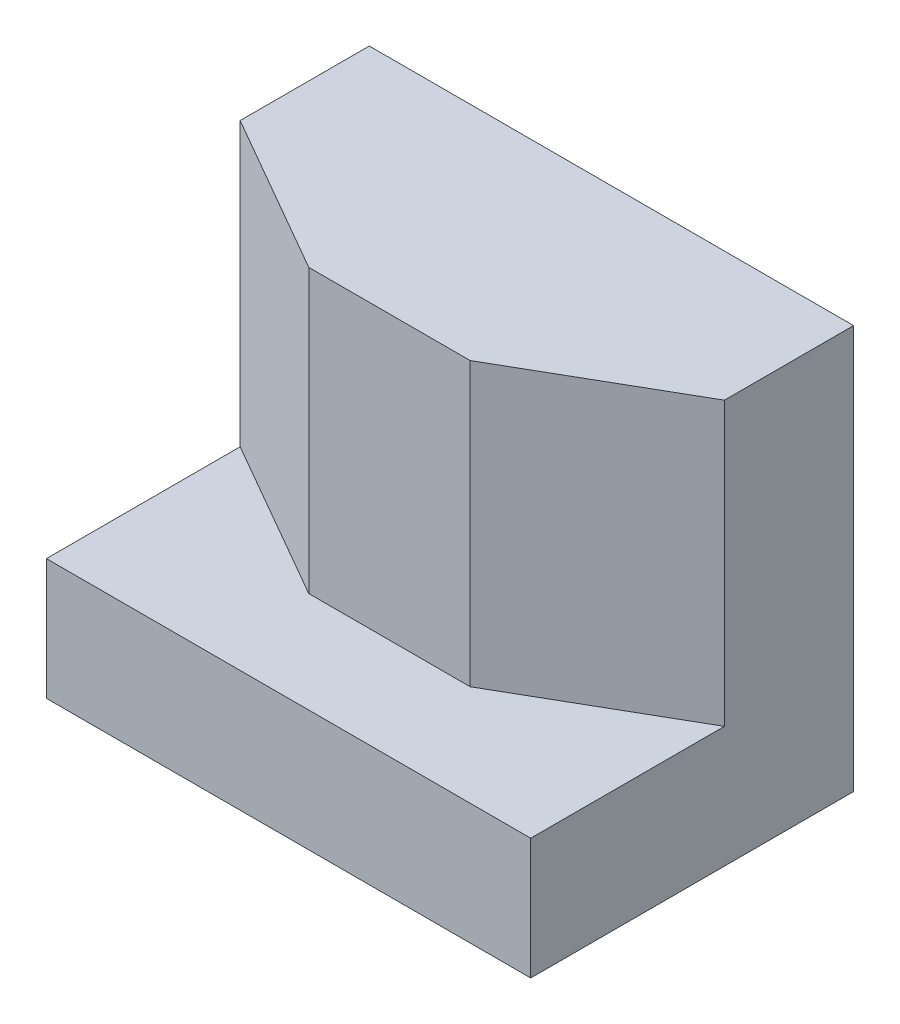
ISO-10303-21;
HEADER;
FILE_DESCRIPTION(('STEP AP214'),'2;1');
FILE_NAME('part.step','',(''),(''),'','','');
FILE_SCHEMA(('AUTOMOTIVE_DESIGN { 1 0 10303 214 1 1 1 1 }'));
ENDSEC;
DATA;
#1=APPLICATION_CONTEXT('core data for automotive mechanical design processes');
#2=APPLICATION_PROTOCOL_DEFINITION('international standard','automotive_design',2000,#1);
#3=PRODUCT_CONTEXT('',#1,'mechanical');
#4=PRODUCT('Part','Part','',(#3));
#5=PRODUCT_RELATED_PRODUCT_CATEGORY('part','',(#4));
#6=PRODUCT_DEFINITION_FORMATION('','',#4);
#7=PRODUCT_DEFINITION_CONTEXT('part definition',#1,'design');
#8=PRODUCT_DEFINITION('design','',#6,#7);
#9=PRODUCT_DEFINITION_SHAPE('','',#8);
#10=(LENGTH_UNIT() NAMED_UNIT(*) SI_UNIT(.MILLI.,.METRE.));
#11=(NAMED_UNIT(*) PLANE_ANGLE_UNIT() SI_UNIT($,.RADIAN.));
#12=(NAMED_UNIT(*) SI_UNIT($,.STERADIAN.) SOLID_ANGLE_UNIT());
#13=UNCERTAINTY_MEASURE_WITH_UNIT(LENGTH_MEASURE(1.E-05),#10,'distance_accuracy_value','');
#14=(GEOMETRIC_REPRESENTATION_CONTEXT(3) GLOBAL_UNCERTAINTY_ASSIGNED_CONTEXT((#13)) GLOBAL_UNIT_ASSIGNED_CONTEXT((#10,
#11,#12)) REPRESENTATION_CONTEXT('',''));
#15=CARTESIAN_POINT('',(0.,0.,0.));
#16=DIRECTION('',(0.,0.,1.));
#17=DIRECTION('',(1.,0.,0.));
#18=AXIS2_PLACEMENT_3D('',#15,#16,#17);
#19=CARTESIAN_POINT('',(-60.,100.,40.));
#20=DIRECTION('',(0.,0.,-1.));
#21=DIRECTION('',(-1.,0.,0.));
#22=AXIS2_PLACEMENT_3D('',#19,#20,#21);
#23=PLANE('',#22);
#24=DIRECTION('',(1.,0.,0.));
#25=VECTOR('',#24,1.);
#26=CARTESIAN_POINT('',(60.,30.,40.));
#27=LINE('',#26,#25);
#28=CARTESIAN_POINT('',(-60.,30.,40.));
#29=VERTEX_POINT('',#28);
#30=CARTESIAN_POINT('',(60.,30.,40.));
#31=VERTEX_POINT('',#30);
#32=EDGE_CURVE('E117',#29,#31,#27,.T.);
#33=ORIENTED_EDGE('',*,*,#32,.F.);
#34=DIRECTION('',(0.,-1.,0.));
#35=VECTOR('',#34,1.);
#36=CARTESIAN_POINT('',(-60.,100.,40.));
#37=LINE('',#36,#35);
#38=CARTESIAN_POINT('',(-60.,0.,40.));
#39=VERTEX_POINT('',#38);
#40=EDGE_CURVE('E11',#29,#39,#37,.T.);
#41=ORIENTED_EDGE('',*,*,#40,.T.);
#42=DIRECTION('',(1.,0.,0.));
#43=VECTOR('',#42,1.);
#44=CARTESIAN_POINT('',(-60.,0.,40.));
#45=LINE('',#44,#43);
#46=CARTESIAN_POINT('',(60.,0.,40.));
#47=VERTEX_POINT('',#46);
#48=EDGE_CURVE('E95',#39,#47,#45,.T.);
#49=ORIENTED_EDGE('',*,*,#48,.T.);
#50=DIRECTION('',(0.,-1.,0.));
#51=VECTOR('',#50,1.);
#52=CARTESIAN_POINT('',(60.,100.,40.));
#53=LINE('',#52,#51);
#54=EDGE_CURVE('E38',#31,#47,#53,.T.);
#55=ORIENTED_EDGE('',*,*,#54,.F.);
#56=EDGE_LOOP('',(#33,#41,#49,#55));
#57=FACE_BOUND('',#56,.T.);
#58=ADVANCED_FACE('F30',(#57),#23,.F.);
#59=CARTESIAN_POINT('',(-60.,100.,-40.));
#60=DIRECTION('',(1.,0.,0.));
#61=DIRECTION('',(0.,0.,-1.));
#62=AXIS2_PLACEMENT_3D('',#59,#60,#61);
#63=PLANE('',#62);
#64=DIRECTION('',(0.,0.,1.));
#65=VECTOR('',#64,1.);
#66=CARTESIAN_POINT('',(-60.,30.,40.));
#67=LINE('',#66,#65);
#68=CARTESIAN_POINT('',(-60.,30.,-8.00000000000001));
#69=VERTEX_POINT('',#68);
#70=EDGE_CURVE('E119',#69,#29,#67,.T.);
#71=ORIENTED_EDGE('',*,*,#70,.F.);
#72=DIRECTION('',(0.,1.,0.));
#73=VECTOR('',#72,1.);
#74=CARTESIAN_POINT('',(-60.,30.,-8.00000000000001));
#75=LINE('',#74,#73);
#76=CARTESIAN_POINT('',(-60.,100.,-8.00000000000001));
#77=VERTEX_POINT('',#76);
#78=EDGE_CURVE('E96',#69,#77,#75,.T.);
#79=ORIENTED_EDGE('',*,*,#78,.T.);
#80=DIRECTION('',(0.,0.,1.));
#81=VECTOR('',#80,1.);
#82=CARTESIAN_POINT('',(-60.,100.,-40.));
#83=LINE('',#82,#81);
#84=CARTESIAN_POINT('',(-60.,100.,-40.));
#85=VERTEX_POINT('',#84);
#86=EDGE_CURVE('E82',#85,#77,#83,.T.);
#87=ORIENTED_EDGE('',*,*,#86,.F.);
#88=DIRECTION('',(0.,-1.,0.));
#89=VECTOR('',#88,1.);
#90=CARTESIAN_POINT('',(-60.,100.,-40.));
#91=LINE('',#90,#89);
#92=CARTESIAN_POINT('',(-60.,0.,-40.));
#93=VERTEX_POINT('',#92);
#94=EDGE_CURVE('E75',#85,#93,#91,.T.);
#95=ORIENTED_EDGE('',*,*,#94,.T.);
#96=DIRECTION('',(0.,0.,1.));
#97=VECTOR('',#96,1.);
#98=CARTESIAN_POINT('',(-60.,0.,-40.));
#99=LINE('',#98,#97);
#100=EDGE_CURVE('E89',#93,#39,#99,.T.);
#101=ORIENTED_EDGE('',*,*,#100,.T.);
#102=ORIENTED_EDGE('',*,*,#40,.F.);
#103=EDGE_LOOP('',(#71,#79,#87,#95,#101,#102));
#104=FACE_BOUND('',#103,.T.);
#105=ADVANCED_FACE('F32',(#104),#63,.F.);
#106=CARTESIAN_POINT('',(60.,100.,-40.));
#107=DIRECTION('',(-1.,0.,0.));
#108=DIRECTION('',(0.,0.,1.));
#109=AXIS2_PLACEMENT_3D('',#106,#107,#108);
#110=PLANE('',#109);
#111=DIRECTION('',(0.,0.,-1.));
#112=VECTOR('',#111,1.);
#113=CARTESIAN_POINT('',(60.,100.,-40.));
#114=LINE('',#113,#112);
#115=CARTESIAN_POINT('',(60.,100.,-8.00000000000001));
#116=VERTEX_POINT('',#115);
#117=CARTESIAN_POINT('',(60.,100.,-40.));
#118=VERTEX_POINT('',#117);
#119=EDGE_CURVE('E166',#116,#118,#114,.T.);
#120=ORIENTED_EDGE('',*,*,#119,.F.);
#121=DIRECTION('',(0.,1.,0.));
#122=VECTOR('',#121,1.);
#123=CARTESIAN_POINT('',(60.,30.,-8.00000000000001));
#124=LINE('',#123,#122);
#125=CARTESIAN_POINT('',(60.,30.,-8.00000000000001));
#126=VERTEX_POINT('',#125);
#127=EDGE_CURVE('E45',#126,#116,#124,.T.);
#128=ORIENTED_EDGE('',*,*,#127,.F.);
#129=DIRECTION('',(0.,0.,-1.));
#130=VECTOR('',#129,1.);
#131=CARTESIAN_POINT('',(60.,30.,-8.00000000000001));
#132=LINE('',#131,#130);
#133=EDGE_CURVE('E112',#31,#126,#132,.T.);
#134=ORIENTED_EDGE('',*,*,#133,.F.);
#135=ORIENTED_EDGE('',*,*,#54,.T.);
#136=DIRECTION('',(0.,0.,-1.));
#137=VECTOR('',#136,1.);
#138=CARTESIAN_POINT('',(60.,0.,-40.));
#139=LINE('',#138,#137);
#140=CARTESIAN_POINT('',(60.,0.,-40.));
#141=VERTEX_POINT('',#140);
#142=EDGE_CURVE('E83',#47,#141,#139,.T.);
#143=ORIENTED_EDGE('',*,*,#142,.T.);
#144=DIRECTION('',(0.,-1.,0.));
#145=VECTOR('',#144,1.);
#146=CARTESIAN_POINT('',(60.,100.,-40.));
#147=LINE('',#146,#145);
#148=EDGE_CURVE('E78',#118,#141,#147,.T.);
#149=ORIENTED_EDGE('',*,*,#148,.F.);
#150=EDGE_LOOP('',(#120,#128,#134,#135,#143,#149));
#151=FACE_BOUND('',#150,.T.);
#152=ADVANCED_FACE('F109',(#151),#110,.F.);
#153=CARTESIAN_POINT('',(-60.,100.,-40.));
#154=DIRECTION('',(0.,0.,1.));
#155=DIRECTION('',(1.,0.,0.));
#156=AXIS2_PLACEMENT_3D('',#153,#154,#155);
#157=PLANE('',#156);
#158=DIRECTION('',(-1.,0.,0.));
#159=VECTOR('',#158,1.);
#160=CARTESIAN_POINT('',(-60.,0.,-40.));
#161=LINE('',#160,#159);
#162=EDGE_CURVE('E72',#141,#93,#161,.T.);
#163=ORIENTED_EDGE('',*,*,#162,.T.);
#164=ORIENTED_EDGE('',*,*,#94,.F.);
#165=DIRECTION('',(-1.,0.,0.));
#166=VECTOR('',#165,1.);
#167=CARTESIAN_POINT('',(-60.,100.,-40.));
#168=LINE('',#167,#166);
#169=EDGE_CURVE('E54',#118,#85,#168,.T.);
#170=ORIENTED_EDGE('',*,*,#169,.F.);
#171=ORIENTED_EDGE('',*,*,#148,.T.);
#172=EDGE_LOOP('',(#163,#164,#170,#171));
#173=FACE_BOUND('',#172,.T.);
#174=ADVANCED_FACE('F74',(#173),#157,.F.);
#175=CARTESIAN_POINT('',(-60.,100.,40.));
#176=DIRECTION('',(0.,1.,0.));
#177=DIRECTION('',(0.,0.,1.));
#178=AXIS2_PLACEMENT_3D('',#175,#176,#177);
#179=PLANE('',#178);
#180=DIRECTION('',(-0.866906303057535,0.,-0.498471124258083));
#181=VECTOR('',#180,1.);
#182=CARTESIAN_POINT('',(-60.,100.,-8.00000000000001));
#183=LINE('',#182,#181);
#184=CARTESIAN_POINT('',(-20.,100.,15.));
#185=VERTEX_POINT('',#184);
#186=EDGE_CURVE('E147',#185,#77,#183,.T.);
#187=ORIENTED_EDGE('',*,*,#186,.F.);
#188=DIRECTION('',(-1.,0.,0.));
#189=VECTOR('',#188,1.);
#190=CARTESIAN_POINT('',(-20.,100.,15.));
#191=LINE('',#190,#189);
#192=CARTESIAN_POINT('',(20.,100.,15.));
#193=VERTEX_POINT('',#192);
#194=EDGE_CURVE('E155',#193,#185,#191,.T.);
#195=ORIENTED_EDGE('',*,*,#194,.F.);
#196=DIRECTION('',(-0.866906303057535,0.,0.498471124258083));
#197=VECTOR('',#196,1.);
#198=CARTESIAN_POINT('',(20.,100.,15.));
#199=LINE('',#198,#197);
#200=EDGE_CURVE('E157',#116,#193,#199,.T.);
#201=ORIENTED_EDGE('',*,*,#200,.F.);
#202=ORIENTED_EDGE('',*,*,#119,.T.);
#203=ORIENTED_EDGE('',*,*,#169,.T.);
#204=ORIENTED_EDGE('',*,*,#86,.T.);
#205=EDGE_LOOP('',(#187,#195,#201,#202,#203,#204));
#206=FACE_BOUND('',#205,.T.);
#207=ADVANCED_FACE('F159',(#206),#179,.T.);
#208=CARTESIAN_POINT('',(-60.,0.,40.));
#209=DIRECTION('',(0.,1.,0.));
#210=DIRECTION('',(0.,0.,1.));
#211=AXIS2_PLACEMENT_3D('',#208,#209,#210);
#212=PLANE('',#211);
#213=ORIENTED_EDGE('',*,*,#100,.F.);
#214=ORIENTED_EDGE('',*,*,#162,.F.);
#215=ORIENTED_EDGE('',*,*,#142,.F.);
#216=ORIENTED_EDGE('',*,*,#48,.F.);
#217=EDGE_LOOP('',(#213,#214,#215,#216));
#218=FACE_BOUND('',#217,.T.);
#219=ADVANCED_FACE('F93',(#218),#212,.F.);
#220=CARTESIAN_POINT('',(-60.,30.,-8.00000000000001));
#221=DIRECTION('',(0.498471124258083,0.,-0.866906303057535));
#222=DIRECTION('',(-0.866906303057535,0.,-0.498471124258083));
#223=AXIS2_PLACEMENT_3D('',#220,#221,#222);
#224=PLANE('',#223);
#225=ORIENTED_EDGE('',*,*,#186,.T.);
#226=ORIENTED_EDGE('',*,*,#78,.F.);
#227=DIRECTION('',(-0.866906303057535,0.,-0.498471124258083));
#228=VECTOR('',#227,1.);
#229=CARTESIAN_POINT('',(-60.,30.,-8.00000000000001));
#230=LINE('',#229,#228);
#231=CARTESIAN_POINT('',(-20.,30.,15.));
#232=VERTEX_POINT('',#231);
#233=EDGE_CURVE('E148',#232,#69,#230,.T.);
#234=ORIENTED_EDGE('',*,*,#233,.F.);
#235=DIRECTION('',(0.,1.,0.));
#236=VECTOR('',#235,1.);
#237=CARTESIAN_POINT('',(-20.,30.,15.));
#238=LINE('',#237,#236);
#239=EDGE_CURVE('E99',#232,#185,#238,.T.);
#240=ORIENTED_EDGE('',*,*,#239,.T.);
#241=EDGE_LOOP('',(#225,#226,#234,#240));
#242=FACE_BOUND('',#241,.T.);
#243=ADVANCED_FACE('F145',(#242),#224,.F.);
#244=CARTESIAN_POINT('',(-20.,30.,15.));
#245=DIRECTION('',(0.,0.,-1.));
#246=DIRECTION('',(-1.,0.,0.));
#247=AXIS2_PLACEMENT_3D('',#244,#245,#246);
#248=PLANE('',#247);
#249=ORIENTED_EDGE('',*,*,#194,.T.);
#250=ORIENTED_EDGE('',*,*,#239,.F.);
#251=DIRECTION('',(-1.,0.,0.));
#252=VECTOR('',#251,1.);
#253=CARTESIAN_POINT('',(-20.,30.,15.));
#254=LINE('',#253,#252);
#255=CARTESIAN_POINT('',(20.,30.,15.));
#256=VERTEX_POINT('',#255);
#257=EDGE_CURVE('E169',#256,#232,#254,.T.);
#258=ORIENTED_EDGE('',*,*,#257,.F.);
#259=DIRECTION('',(0.,1.,0.));
#260=VECTOR('',#259,1.);
#261=CARTESIAN_POINT('',(20.,30.,15.));
#262=LINE('',#261,#260);
#263=EDGE_CURVE('E152',#256,#193,#262,.T.);
#264=ORIENTED_EDGE('',*,*,#263,.T.);
#265=EDGE_LOOP('',(#249,#250,#258,#264));
#266=FACE_BOUND('',#265,.T.);
#267=ADVANCED_FACE('F156',(#266),#248,.F.);
#268=CARTESIAN_POINT('',(20.,30.,15.));
#269=DIRECTION('',(-0.498471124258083,0.,-0.866906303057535));
#270=DIRECTION('',(-0.866906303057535,0.,0.498471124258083));
#271=AXIS2_PLACEMENT_3D('',#268,#269,#270);
#272=PLANE('',#271);
#273=ORIENTED_EDGE('',*,*,#200,.T.);
#274=ORIENTED_EDGE('',*,*,#263,.F.);
#275=DIRECTION('',(-0.866906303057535,0.,0.498471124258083));
#276=VECTOR('',#275,1.);
#277=CARTESIAN_POINT('',(20.,30.,15.));
#278=LINE('',#277,#276);
#279=EDGE_CURVE('E171',#126,#256,#278,.T.);
#280=ORIENTED_EDGE('',*,*,#279,.F.);
#281=ORIENTED_EDGE('',*,*,#127,.T.);
#282=EDGE_LOOP('',(#273,#274,#280,#281));
#283=FACE_BOUND('',#282,.T.);
#284=ADVANCED_FACE('F176',(#283),#272,.F.);
#285=CARTESIAN_POINT('',(-60.,30.,40.));
#286=DIRECTION('',(0.,1.,0.));
#287=DIRECTION('',(0.,0.,1.));
#288=AXIS2_PLACEMENT_3D('',#285,#286,#287);
#289=PLANE('',#288);
#290=ORIENTED_EDGE('',*,*,#70,.T.);
#291=ORIENTED_EDGE('',*,*,#32,.T.);
#292=ORIENTED_EDGE('',*,*,#133,.T.);
#293=ORIENTED_EDGE('',*,*,#279,.T.);
#294=ORIENTED_EDGE('',*,*,#257,.T.);
#295=ORIENTED_EDGE('',*,*,#233,.T.);
#296=EDGE_LOOP('',(#290,#291,#292,#293,#294,#295));
#297=FACE_BOUND('',#296,.T.);
#298=ADVANCED_FACE('F175',(#297),#289,.T.);
#299=CLOSED_SHELL('',(#58,#105,#152,#174,#207,#219,#243,#267,#284,#298));
#300=MANIFOLD_SOLID_BREP('B2',#299);
#301=ADVANCED_BREP_SHAPE_REPRESENTATION('',(#18,#300),#14);
#302=SHAPE_DEFINITION_REPRESENTATION(#9,#301);
ENDSEC;
END-ISO-10303-21;
